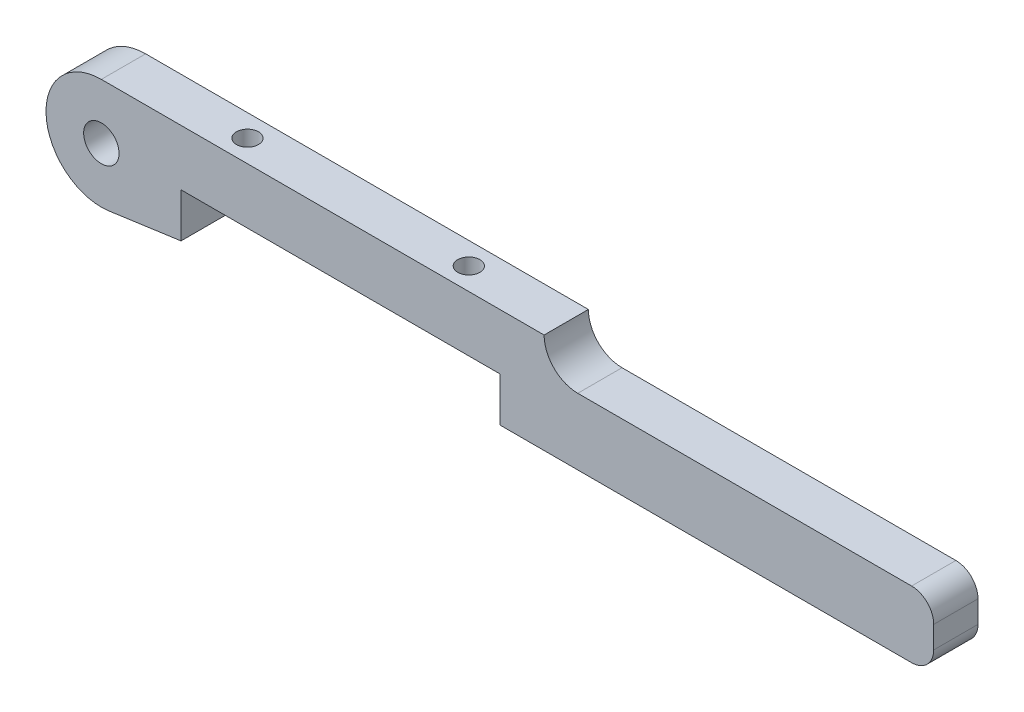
from build123d import *

# Parameters (mm, degrees)
SKETCH1_R           = 5.08
BOSS_EXTRUDE1_DEPTH = 6.35
SKETCH2_R           = 3.175
CUT_EXTRUDE1_DEPTH  = 29.972


with BuildPart() as part:
    # Sketch1 → Boss-Extrude1 (new, symmetric)
    with BuildSketch(Plane.XY):
        with BuildLine():
            Line((0, 15.875), (127, 15.875))
            ThreePointArc((127, 15.875), (129.827005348, 9.050005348), (136.652, 6.223))
            Line((136.652, 6.223), (232.41, 6.223))
            ThreePointArc((232.41, 6.223), (236.900128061, 4.363128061), (238.76, -0.127))
            Line((238.76, -0.127), (238.76, -6.477))
            ThreePointArc((238.76, -6.477), (236.900128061, -10.967128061), (232.41, -12.827))
            Line((232.41, -12.827), (114.3, -12.827))
            Line((114.3, -12.827), (114.3, -0.127))
            Line((114.3, -0.127), (22.86, -0.127))
            Line((22.86, -0.127), (22.86, -12.827))
            Line((22.86, -12.827), (2.202840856, -15.721422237))
            ThreePointArc((2.202840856, -15.721422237), (-15.836559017, -1.104093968), (0, 15.875))
        make_face()
        Circle(SKETCH1_R, mode=Mode.SUBTRACT)
    extrude(amount=BOSS_EXTRUDE1_DEPTH, both=True)

    # Sketch2 → Cut-Extrude1 (cut)
    with BuildSketch(Plane(origin=(0, 15.875, 0), x_dir=(1, 0, 0), z_dir=(0, 1, 0))):
        with Locations(Location((35.56, 0, 0), (0, 0, 270))):
            Circle(SKETCH2_R)
        with Locations(Location((99.06, 0, 0), (0, 0, 270))):
            Circle(SKETCH2_R)
    extrude(amount=-CUT_EXTRUDE1_DEPTH, mode=Mode.SUBTRACT)


solid = part.part
